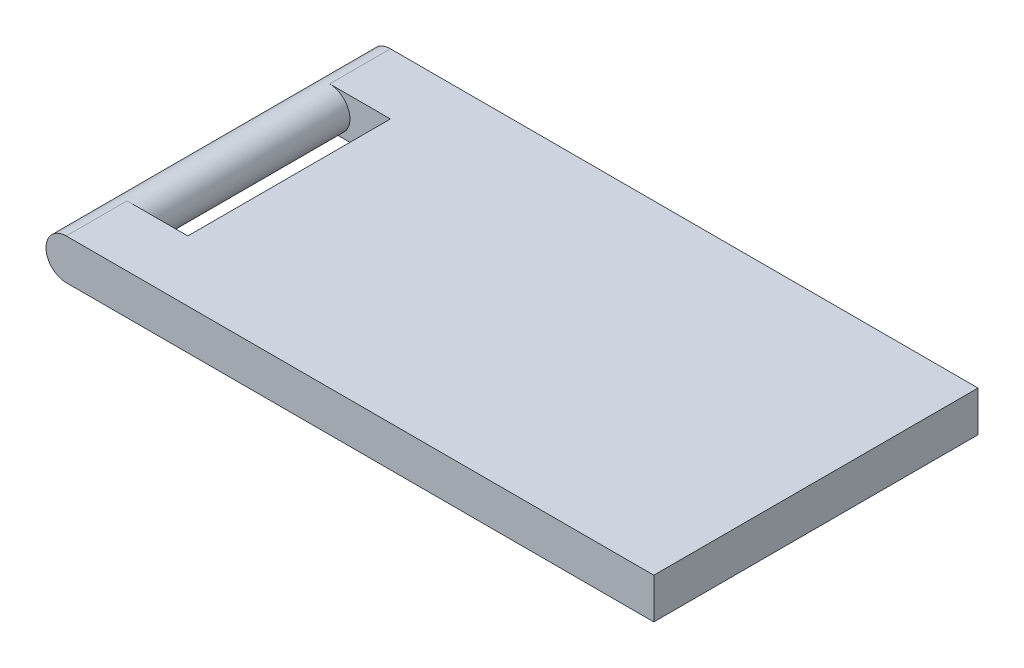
from build123d import *

# Parameters (mm, degrees)
EXTRUDE1_DEPTH = 10
FILLET4_RADIUS = 5
FILLET4_LENGTH = 15
FILLET5_RADIUS = 5
FILLET5_LENGTH = 15
EXTRUDE3_REACH = 165.783
SKETCH3_R      = 5


with BuildPart() as part:
    # Sketch1 → Extrude1 (new body)
    with BuildSketch(Plane(origin=(0, 0, 0), x_dir=(1, 0, 0), z_dir=(0, 1, 0))):
        Polygon((0, -25), (0, -40), (150, -40), (150, 40), (0, 40), (0, 25), (20, 25), (20, -25), align=None)
    extrude(amount=EXTRUDE1_DEPTH)

    # Fillet4: full round fillet: the end face becomes a half cylinder, R = half its width
    fillet4_face = Plane((0, 5, -32.5), x_dir=(0, 0, 1), z_dir=(-1, 0, 0))  # on the end face: x along it, z out of the body
    fillet4_slab = fillet4_face.offset(-FILLET4_RADIUS / 2) * Box(FILLET4_LENGTH, 2 * FILLET4_RADIUS, FILLET4_RADIUS, mode=Mode.PRIVATE)  # the body's end, R deep
    fillet4_round = Plane((5, 5, -32.5), x_dir=(-1, 0, 0), z_dir=(0, 0, 1)) * Cylinder(FILLET4_RADIUS, FILLET4_LENGTH, mode=Mode.PRIVATE)  # its axis R under the face
    add(fillet4_slab - fillet4_round, mode=Mode.SUBTRACT)

    # Fillet5: full round fillet: the end face becomes a half cylinder, R = half its width
    fillet5_face = Plane((0, 5, 32.5), x_dir=(0, 0, -1), z_dir=(-1, 0, 0))  # on the end face: x along it, z out of the body
    fillet5_slab = fillet5_face.offset(-FILLET5_RADIUS / 2) * Box(FILLET5_LENGTH, 2 * FILLET5_RADIUS, FILLET5_RADIUS, mode=Mode.PRIVATE)  # the body's end, R deep
    fillet5_round = Plane((5, 5, 32.5), x_dir=(-1, 0, 0), z_dir=(0, 0, -1)) * Cylinder(FILLET5_RADIUS, FILLET5_LENGTH, mode=Mode.PRIVATE)  # its axis R under the face
    add(fillet5_slab - fillet5_round, mode=Mode.SUBTRACT)

    # Sketch3 → Extrude3 (add, up to next)
    with BuildSketch(Plane.XY.offset(-25), mode=Mode.PRIVATE) as extrude3_sk1:
        with Locations(Location((5, 5, 0), (0, 0, 270))):
            Circle(SKETCH3_R)
    extrude3_tool1 = extrude(extrude3_sk1.sketch, amount=EXTRUDE3_REACH, mode=Mode.PRIVATE) - part.part
    add(extrude3_tool1.solids().sort_by_distance((5, 5, -25))[0])


solid = part.part
